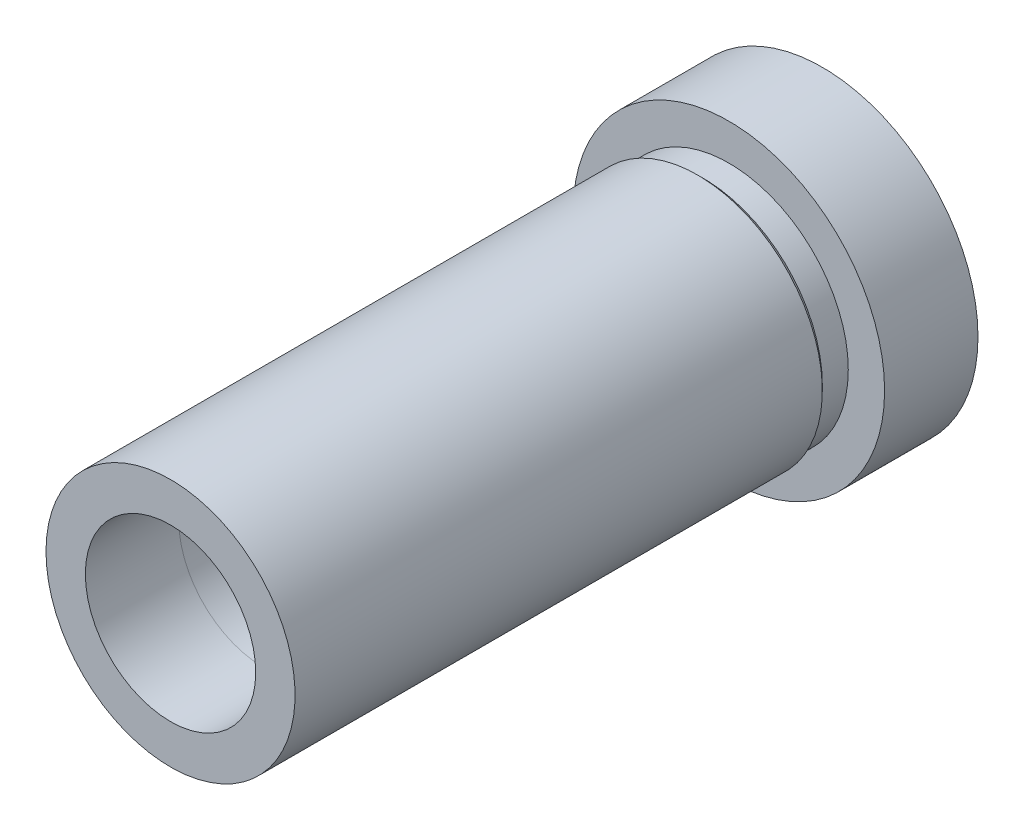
from build123d import *


with BuildPart() as part:
    # Logo3_bib1 → Revolve1 (revolve)
    with BuildSketch(Plane(origin=(0, 0, 0), x_dir=(-1, 0, 0), z_dir=(0, -1, 0))):
        Polygon((4.3434, -28.4734), (6.35, -28.4734), (6.35, -1.5875), (6.085416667, -1.322916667), (6.085416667, 0), (7.9375, 0), (7.9375, 4.7625), (4.50341238, 4.7625), (4.3434, -23.7109), align=None)
    revolve(axis=Axis((0, 0, -19.432293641), (0, 0, 1)))


solid = part.part
